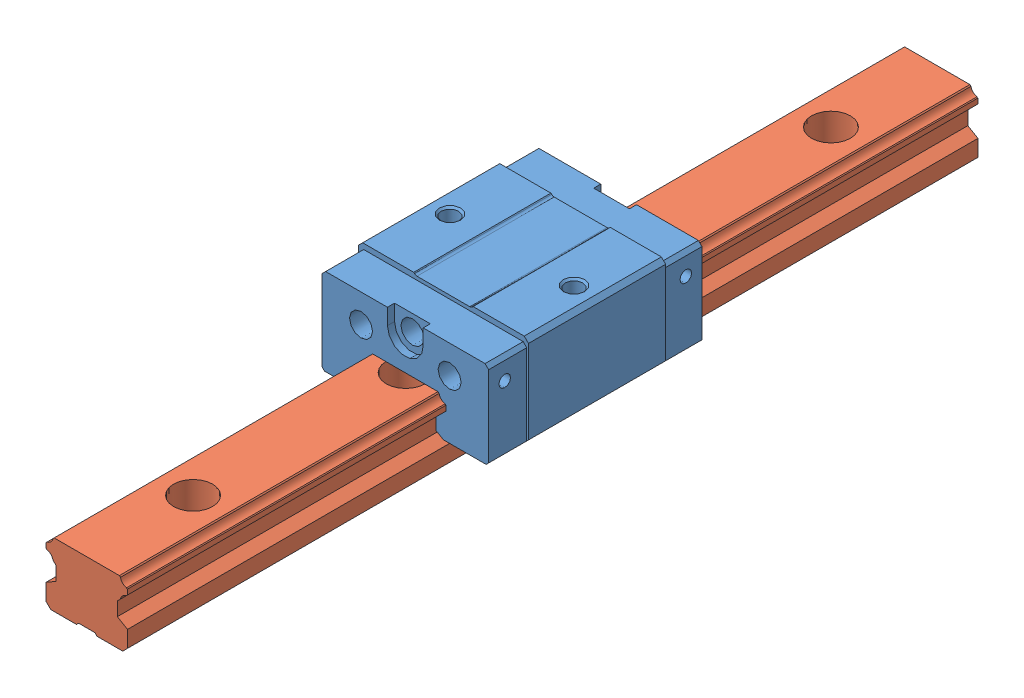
SolidWorks assembly ELH25SA1R240 E=30.sldasm, configuration Default (file format 13000). Lengths in mm.
Overall size (48 33.01 240).
2 component instances, 2 part files, 0 mates.
Components (placement in the parent):
- ELH25SA-1: ELH25SA.SLDPRT [Default] at (0 33 -89.9) size (48 26 60.2)
- ELR25R240 E=30-1: ELR25R240 E=30.SLDPRT [Default] at (0 33 0) size (23 18 240)
